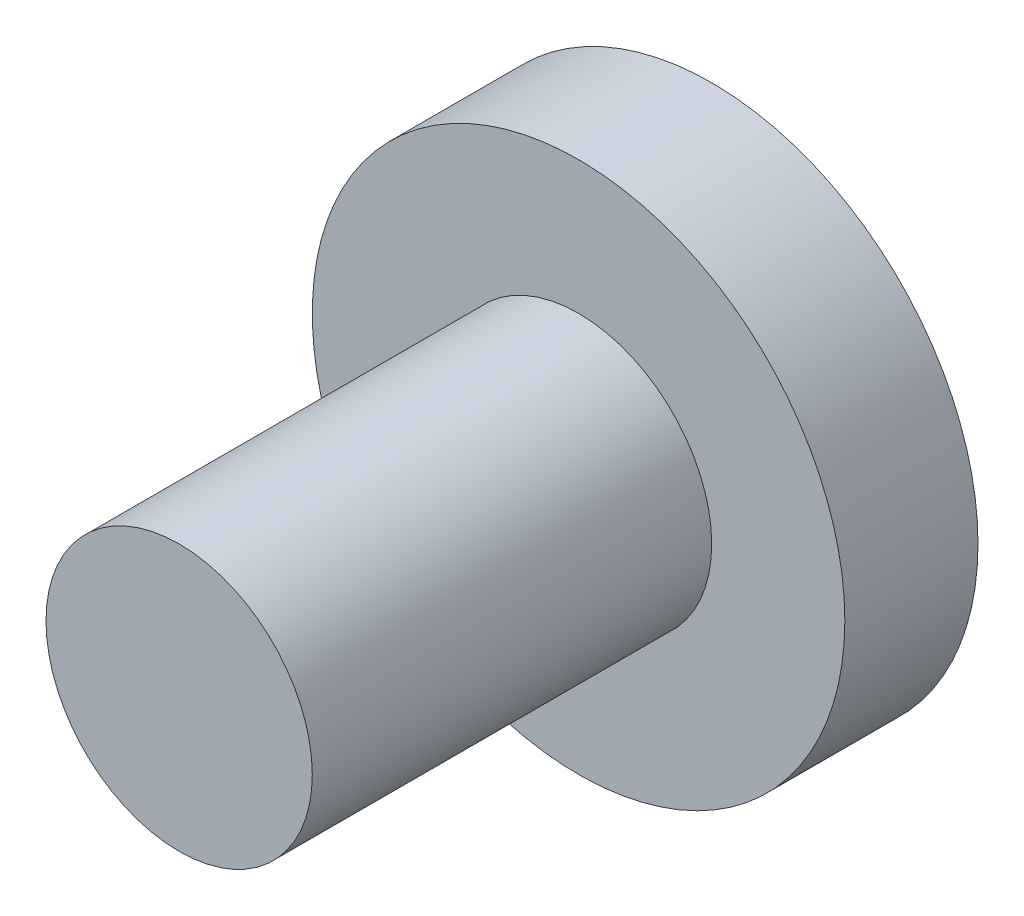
ISO-10303-21;
HEADER;
FILE_DESCRIPTION(('STEP AP214'),'2;1');
FILE_NAME('part.step','',(''),(''),'','','');
FILE_SCHEMA(('AUTOMOTIVE_DESIGN { 1 0 10303 214 1 1 1 1 }'));
ENDSEC;
DATA;
#1=APPLICATION_CONTEXT('core data for automotive mechanical design processes');
#2=APPLICATION_PROTOCOL_DEFINITION('international standard','automotive_design',2000,#1);
#3=PRODUCT_CONTEXT('',#1,'mechanical');
#4=PRODUCT('Part','Part','',(#3));
#5=PRODUCT_RELATED_PRODUCT_CATEGORY('part','',(#4));
#6=PRODUCT_DEFINITION_FORMATION('','',#4);
#7=PRODUCT_DEFINITION_CONTEXT('part definition',#1,'design');
#8=PRODUCT_DEFINITION('design','',#6,#7);
#9=PRODUCT_DEFINITION_SHAPE('','',#8);
#10=(LENGTH_UNIT() NAMED_UNIT(*) SI_UNIT(.MILLI.,.METRE.));
#11=(NAMED_UNIT(*) PLANE_ANGLE_UNIT() SI_UNIT($,.RADIAN.));
#12=(NAMED_UNIT(*) SI_UNIT($,.STERADIAN.) SOLID_ANGLE_UNIT());
#13=UNCERTAINTY_MEASURE_WITH_UNIT(LENGTH_MEASURE(1.E-05),#10,'distance_accuracy_value','');
#14=(GEOMETRIC_REPRESENTATION_CONTEXT(3) GLOBAL_UNCERTAINTY_ASSIGNED_CONTEXT((#13)) GLOBAL_UNIT_ASSIGNED_CONTEXT((#10,
#11,#12)) REPRESENTATION_CONTEXT('',''));
#15=CARTESIAN_POINT('',(0.,0.,0.));
#16=DIRECTION('',(0.,0.,1.));
#17=DIRECTION('',(1.,0.,0.));
#18=AXIS2_PLACEMENT_3D('',#15,#16,#17);
#19=CARTESIAN_POINT('',(0.,0.,20.));
#20=DIRECTION('',(0.,0.,-1.));
#21=DIRECTION('',(-1.,0.,0.));
#22=AXIS2_PLACEMENT_3D('',#19,#20,#21);
#23=CYLINDRICAL_SURFACE('',#22,10.);
#24=CARTESIAN_POINT('',(0.,0.,0.));
#25=DIRECTION('',(0.,0.,1.));
#26=DIRECTION('',(1.,0.,0.));
#27=AXIS2_PLACEMENT_3D('',#24,#25,#26);
#28=CIRCLE('',#27,10.);
#29=CARTESIAN_POINT('',(10.,0.,0.));
#30=VERTEX_POINT('',#29);
#31=EDGE_CURVE('E10',#30,#30,#28,.T.);
#32=ORIENTED_EDGE('',*,*,#31,.T.);
#33=EDGE_LOOP('',(#32));
#34=FACE_BOUND('',#33,.T.);
#35=CARTESIAN_POINT('',(0.,0.,5.));
#36=DIRECTION('',(0.,0.,1.));
#37=DIRECTION('',(1.,0.,0.));
#38=AXIS2_PLACEMENT_3D('',#35,#36,#37);
#39=CIRCLE('',#38,10.);
#40=CARTESIAN_POINT('',(10.,0.,5.));
#41=VERTEX_POINT('',#40);
#42=EDGE_CURVE('E25',#41,#41,#39,.T.);
#43=ORIENTED_EDGE('',*,*,#42,.F.);
#44=EDGE_LOOP('',(#43));
#45=FACE_BOUND('',#44,.T.);
#46=ADVANCED_FACE('F22',(#34,#45),#23,.T.);
#47=CARTESIAN_POINT('',(0.,0.,0.));
#48=DIRECTION('',(0.,0.,1.));
#49=DIRECTION('',(1.,0.,0.));
#50=AXIS2_PLACEMENT_3D('',#47,#48,#49);
#51=PLANE('',#50);
#52=ORIENTED_EDGE('',*,*,#31,.F.);
#53=EDGE_LOOP('',(#52));
#54=FACE_BOUND('',#53,.T.);
#55=ADVANCED_FACE('F51',(#54),#51,.F.);
#56=CARTESIAN_POINT('',(0.,0.,5.));
#57=DIRECTION('',(0.,0.,1.));
#58=DIRECTION('',(1.,0.,0.));
#59=AXIS2_PLACEMENT_3D('',#56,#57,#58);
#60=PLANE('',#59);
#61=CARTESIAN_POINT('',(0.,0.,5.));
#62=DIRECTION('',(0.,0.,1.));
#63=DIRECTION('',(1.,0.,0.));
#64=AXIS2_PLACEMENT_3D('',#61,#62,#63);
#65=CIRCLE('',#64,5.);
#66=CARTESIAN_POINT('',(5.,0.,5.));
#67=VERTEX_POINT('',#66);
#68=EDGE_CURVE('E32',#67,#67,#65,.T.);
#69=ORIENTED_EDGE('',*,*,#68,.F.);
#70=EDGE_LOOP('',(#69));
#71=FACE_BOUND('',#70,.T.);
#72=ORIENTED_EDGE('',*,*,#42,.T.);
#73=EDGE_LOOP('',(#72));
#74=FACE_BOUND('',#73,.T.);
#75=ADVANCED_FACE('F44',(#71,#74),#60,.T.);
#76=CARTESIAN_POINT('',(0.,0.,5.));
#77=DIRECTION('',(0.,0.,1.));
#78=DIRECTION('',(1.,0.,0.));
#79=AXIS2_PLACEMENT_3D('',#76,#77,#78);
#80=CYLINDRICAL_SURFACE('',#79,5.);
#81=ORIENTED_EDGE('',*,*,#68,.T.);
#82=EDGE_LOOP('',(#81));
#83=FACE_BOUND('',#82,.T.);
#84=CARTESIAN_POINT('',(0.,0.,20.));
#85=DIRECTION('',(0.,0.,1.));
#86=DIRECTION('',(1.,0.,0.));
#87=AXIS2_PLACEMENT_3D('',#84,#85,#86);
#88=CIRCLE('',#87,5.);
#89=CARTESIAN_POINT('',(5.,0.,20.));
#90=VERTEX_POINT('',#89);
#91=EDGE_CURVE('E36',#90,#90,#88,.T.);
#92=ORIENTED_EDGE('',*,*,#91,.F.);
#93=EDGE_LOOP('',(#92));
#94=FACE_BOUND('',#93,.T.);
#95=ADVANCED_FACE('F42',(#83,#94),#80,.T.);
#96=CARTESIAN_POINT('',(0.,0.,20.));
#97=DIRECTION('',(0.,0.,1.));
#98=DIRECTION('',(1.,0.,0.));
#99=AXIS2_PLACEMENT_3D('',#96,#97,#98);
#100=PLANE('',#99);
#101=ORIENTED_EDGE('',*,*,#91,.T.);
#102=EDGE_LOOP('',(#101));
#103=FACE_BOUND('',#102,.T.);
#104=ADVANCED_FACE('F40',(#103),#100,.T.);
#105=CLOSED_SHELL('',(#46,#55,#75,#95,#104));
#106=MANIFOLD_SOLID_BREP('B2',#105);
#107=ADVANCED_BREP_SHAPE_REPRESENTATION('',(#18,#106),#14);
#108=SHAPE_DEFINITION_REPRESENTATION(#9,#107);
ENDSEC;
END-ISO-10303-21;
